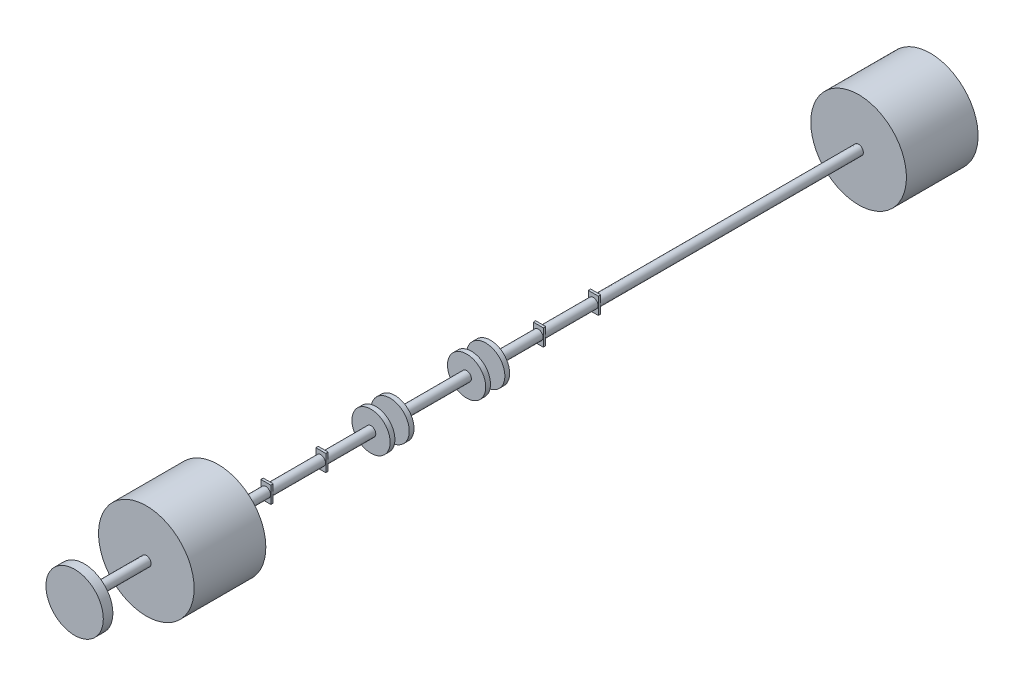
ISO-10303-21;
HEADER;
FILE_DESCRIPTION(('STEP AP214'),'2;1');
FILE_NAME('part.step','',(''),(''),'','','');
FILE_SCHEMA(('AUTOMOTIVE_DESIGN { 1 0 10303 214 1 1 1 1 }'));
ENDSEC;
DATA;
#1=APPLICATION_CONTEXT('core data for automotive mechanical design processes');
#2=APPLICATION_PROTOCOL_DEFINITION('international standard','automotive_design',2000,#1);
#3=PRODUCT_CONTEXT('',#1,'mechanical');
#4=PRODUCT('Part','Part','',(#3));
#5=PRODUCT_RELATED_PRODUCT_CATEGORY('part','',(#4));
#6=PRODUCT_DEFINITION_FORMATION('','',#4);
#7=PRODUCT_DEFINITION_CONTEXT('part definition',#1,'design');
#8=PRODUCT_DEFINITION('design','',#6,#7);
#9=PRODUCT_DEFINITION_SHAPE('','',#8);
#10=(LENGTH_UNIT() NAMED_UNIT(*) SI_UNIT(.MILLI.,.METRE.));
#11=(NAMED_UNIT(*) PLANE_ANGLE_UNIT() SI_UNIT($,.RADIAN.));
#12=(NAMED_UNIT(*) SI_UNIT($,.STERADIAN.) SOLID_ANGLE_UNIT());
#13=UNCERTAINTY_MEASURE_WITH_UNIT(LENGTH_MEASURE(1.E-05),#10,'distance_accuracy_value','');
#14=(GEOMETRIC_REPRESENTATION_CONTEXT(3) GLOBAL_UNCERTAINTY_ASSIGNED_CONTEXT((#13)) GLOBAL_UNIT_ASSIGNED_CONTEXT((#10,
#11,#12)) REPRESENTATION_CONTEXT('',''));
#15=CARTESIAN_POINT('',(0.,0.,0.));
#16=DIRECTION('',(0.,0.,1.));
#17=DIRECTION('',(1.,0.,0.));
#18=AXIS2_PLACEMENT_3D('',#15,#16,#17);
#19=CARTESIAN_POINT('',(0.,0.,250.));
#20=DIRECTION('',(0.,0.,1.));
#21=DIRECTION('',(1.,0.,0.));
#22=AXIS2_PLACEMENT_3D('',#19,#20,#21);
#23=PLANE('',#22);
#24=CARTESIAN_POINT('',(0.,0.,250.));
#25=DIRECTION('',(0.,0.,1.));
#26=DIRECTION('',(1.,0.,0.));
#27=AXIS2_PLACEMENT_3D('',#24,#25,#26);
#28=CIRCLE('',#27,100.);
#29=CARTESIAN_POINT('',(100.,0.,250.));
#30=VERTEX_POINT('',#29);
#31=EDGE_CURVE('E417',#30,#30,#28,.T.);
#32=ORIENTED_EDGE('',*,*,#31,.T.);
#33=EDGE_LOOP('',(#32));
#34=FACE_BOUND('',#33,.T.);
#35=CARTESIAN_POINT('',(0.,0.,250.));
#36=DIRECTION('',(0.,0.,1.));
#37=DIRECTION('',(1.,0.,0.));
#38=AXIS2_PLACEMENT_3D('',#35,#36,#37);
#39=CIRCLE('',#38,10.);
#40=CARTESIAN_POINT('',(10.,0.,250.));
#41=VERTEX_POINT('',#40);
#42=EDGE_CURVE('E403',#41,#41,#39,.T.);
#43=ORIENTED_EDGE('',*,*,#42,.F.);
#44=EDGE_LOOP('',(#43));
#45=FACE_BOUND('',#44,.T.);
#46=ADVANCED_FACE('F41',(#34,#45),#23,.T.);
#47=CARTESIAN_POINT('',(0.,0.,-230.));
#48=DIRECTION('',(0.,0.,-1.));
#49=DIRECTION('',(-1.,0.,0.));
#50=AXIS2_PLACEMENT_3D('',#47,#48,#49);
#51=PLANE('',#50);
#52=CARTESIAN_POINT('',(0.,0.,-230.));
#53=DIRECTION('',(0.,0.,-1.));
#54=DIRECTION('',(-1.,0.,0.));
#55=AXIS2_PLACEMENT_3D('',#52,#53,#54);
#56=CIRCLE('',#55,40.);
#57=CARTESIAN_POINT('',(-40.,0.,-230.));
#58=VERTEX_POINT('',#57);
#59=EDGE_CURVE('E418',#58,#58,#56,.T.);
#60=ORIENTED_EDGE('',*,*,#59,.T.);
#61=EDGE_LOOP('',(#60));
#62=FACE_BOUND('',#61,.T.);
#63=ADVANCED_FACE('F169',(#62),#51,.T.);
#64=CARTESIAN_POINT('',(10.5,17.5,-120.));
#65=DIRECTION('',(0.,0.,-1.));
#66=DIRECTION('',(-1.,0.,0.));
#67=AXIS2_PLACEMENT_3D('',#64,#65,#66);
#68=PLANE('',#67);
#69=DIRECTION('',(1.,0.,0.));
#70=VECTOR('',#69,1.);
#71=CARTESIAN_POINT('',(-10.5,17.5,-120.));
#72=LINE('',#71,#70);
#73=CARTESIAN_POINT('',(-10.5,17.5,-120.));
#74=VERTEX_POINT('',#73);
#75=CARTESIAN_POINT('',(10.5,17.5,-120.));
#76=VERTEX_POINT('',#75);
#77=EDGE_CURVE('E422',#74,#76,#72,.T.);
#78=ORIENTED_EDGE('',*,*,#77,.T.);
#79=DIRECTION('',(0.,-1.,0.));
#80=VECTOR('',#79,1.);
#81=CARTESIAN_POINT('',(10.5,17.5,-120.));
#82=LINE('',#81,#80);
#83=CARTESIAN_POINT('',(10.5,-17.5,-120.));
#84=VERTEX_POINT('',#83);
#85=EDGE_CURVE('E444',#76,#84,#82,.T.);
#86=ORIENTED_EDGE('',*,*,#85,.T.);
#87=DIRECTION('',(-1.,0.,0.));
#88=VECTOR('',#87,1.);
#89=CARTESIAN_POINT('',(10.5,-17.5,-120.));
#90=LINE('',#89,#88);
#91=CARTESIAN_POINT('',(-10.5,-17.5,-120.));
#92=VERTEX_POINT('',#91);
#93=EDGE_CURVE('E134',#84,#92,#90,.T.);
#94=ORIENTED_EDGE('',*,*,#93,.T.);
#95=DIRECTION('',(0.,1.,0.));
#96=VECTOR('',#95,1.);
#97=CARTESIAN_POINT('',(-10.5,-17.5,-120.));
#98=LINE('',#97,#96);
#99=EDGE_CURVE('E131',#92,#74,#98,.T.);
#100=ORIENTED_EDGE('',*,*,#99,.T.);
#101=EDGE_LOOP('',(#78,#86,#94,#100));
#102=FACE_BOUND('',#101,.T.);
#103=CARTESIAN_POINT('',(0.,0.,-120.));
#104=DIRECTION('',(0.,0.,-1.));
#105=DIRECTION('',(-1.,0.,0.));
#106=AXIS2_PLACEMENT_3D('',#103,#104,#105);
#107=CIRCLE('',#106,10.);
#108=CARTESIAN_POINT('',(-10.,0.,-120.));
#109=VERTEX_POINT('',#108);
#110=EDGE_CURVE('E423',#109,#109,#107,.T.);
#111=ORIENTED_EDGE('',*,*,#110,.F.);
#112=EDGE_LOOP('',(#111));
#113=FACE_BOUND('',#112,.T.);
#114=ADVANCED_FACE('F166',(#102,#113),#68,.T.);
#115=CARTESIAN_POINT('',(10.5,-17.5,-5.));
#116=DIRECTION('',(0.,0.,-1.));
#117=DIRECTION('',(-1.,0.,0.));
#118=AXIS2_PLACEMENT_3D('',#115,#116,#117);
#119=PLANE('',#118);
#120=DIRECTION('',(0.,-1.,0.));
#121=VECTOR('',#120,1.);
#122=CARTESIAN_POINT('',(10.5,17.5,-5.));
#123=LINE('',#122,#121);
#124=CARTESIAN_POINT('',(10.5,17.5,-5.));
#125=VERTEX_POINT('',#124);
#126=CARTESIAN_POINT('',(10.5,-17.5,-5.));
#127=VERTEX_POINT('',#126);
#128=EDGE_CURVE('E111',#125,#127,#123,.T.);
#129=ORIENTED_EDGE('',*,*,#128,.T.);
#130=DIRECTION('',(-1.,0.,0.));
#131=VECTOR('',#130,1.);
#132=CARTESIAN_POINT('',(10.5,-17.5,-5.));
#133=LINE('',#132,#131);
#134=CARTESIAN_POINT('',(-10.5,-17.5,-5.));
#135=VERTEX_POINT('',#134);
#136=EDGE_CURVE('E130',#127,#135,#133,.T.);
#137=ORIENTED_EDGE('',*,*,#136,.T.);
#138=DIRECTION('',(0.,1.,0.));
#139=VECTOR('',#138,1.);
#140=CARTESIAN_POINT('',(-10.5,17.5,-5.));
#141=LINE('',#140,#139);
#142=CARTESIAN_POINT('',(-10.5,17.5,-5.));
#143=VERTEX_POINT('',#142);
#144=EDGE_CURVE('E102',#135,#143,#141,.T.);
#145=ORIENTED_EDGE('',*,*,#144,.T.);
#146=DIRECTION('',(1.,0.,0.));
#147=VECTOR('',#146,1.);
#148=CARTESIAN_POINT('',(10.5,17.5,-5.));
#149=LINE('',#148,#147);
#150=EDGE_CURVE('E106',#143,#125,#149,.T.);
#151=ORIENTED_EDGE('',*,*,#150,.T.);
#152=EDGE_LOOP('',(#129,#137,#145,#151));
#153=FACE_BOUND('',#152,.T.);
#154=CARTESIAN_POINT('',(0.,0.,-5.));
#155=DIRECTION('',(0.,0.,-1.));
#156=DIRECTION('',(-1.,0.,0.));
#157=AXIS2_PLACEMENT_3D('',#154,#155,#156);
#158=CIRCLE('',#157,10.);
#159=CARTESIAN_POINT('',(-10.,0.,-5.));
#160=VERTEX_POINT('',#159);
#161=EDGE_CURVE('E142',#160,#160,#158,.T.);
#162=ORIENTED_EDGE('',*,*,#161,.F.);
#163=EDGE_LOOP('',(#162));
#164=FACE_BOUND('',#163,.T.);
#165=ADVANCED_FACE('F108',(#153,#164),#119,.T.);
#166=CARTESIAN_POINT('',(0.,0.,100.));
#167=DIRECTION('',(0.,0.,-1.));
#168=DIRECTION('',(-1.,0.,0.));
#169=AXIS2_PLACEMENT_3D('',#166,#167,#168);
#170=CYLINDRICAL_SURFACE('',#169,10.);
#171=CARTESIAN_POINT('',(0.,0.,100.));
#172=DIRECTION('',(0.,0.,1.));
#173=DIRECTION('',(1.,0.,0.));
#174=AXIS2_PLACEMENT_3D('',#171,#172,#173);
#175=CIRCLE('',#174,10.);
#176=CARTESIAN_POINT('',(10.,0.,100.));
#177=VERTEX_POINT('',#176);
#178=EDGE_CURVE('E45',#177,#177,#175,.T.);
#179=ORIENTED_EDGE('',*,*,#178,.F.);
#180=EDGE_LOOP('',(#179));
#181=FACE_BOUND('',#180,.T.);
#182=CARTESIAN_POINT('',(0.,0.,0.));
#183=DIRECTION('',(0.,0.,-1.));
#184=DIRECTION('',(-1.,0.,0.));
#185=AXIS2_PLACEMENT_3D('',#182,#183,#184);
#186=CIRCLE('',#185,10.);
#187=CARTESIAN_POINT('',(-10.,0.,0.));
#188=VERTEX_POINT('',#187);
#189=EDGE_CURVE('E147',#188,#188,#186,.T.);
#190=ORIENTED_EDGE('',*,*,#189,.F.);
#191=EDGE_LOOP('',(#190));
#192=FACE_BOUND('',#191,.T.);
#193=ADVANCED_FACE('F43',(#181,#192),#170,.T.);
#194=CARTESIAN_POINT('',(10.5,-17.5,0.));
#195=DIRECTION('',(0.,0.,-1.));
#196=DIRECTION('',(-1.,0.,0.));
#197=AXIS2_PLACEMENT_3D('',#194,#195,#196);
#198=PLANE('',#197);
#199=DIRECTION('',(0.,-1.,0.));
#200=VECTOR('',#199,1.);
#201=CARTESIAN_POINT('',(10.5,17.5,0.));
#202=LINE('',#201,#200);
#203=CARTESIAN_POINT('',(10.5,17.5,0.));
#204=VERTEX_POINT('',#203);
#205=CARTESIAN_POINT('',(10.5,-17.5,0.));
#206=VERTEX_POINT('',#205);
#207=EDGE_CURVE('E125',#204,#206,#202,.T.);
#208=ORIENTED_EDGE('',*,*,#207,.F.);
#209=DIRECTION('',(1.,0.,0.));
#210=VECTOR('',#209,1.);
#211=CARTESIAN_POINT('',(10.5,17.5,0.));
#212=LINE('',#211,#210);
#213=CARTESIAN_POINT('',(-10.5,17.5,0.));
#214=VERTEX_POINT('',#213);
#215=EDGE_CURVE('E120',#214,#204,#212,.T.);
#216=ORIENTED_EDGE('',*,*,#215,.F.);
#217=DIRECTION('',(0.,1.,0.));
#218=VECTOR('',#217,1.);
#219=CARTESIAN_POINT('',(-10.5,17.5,0.));
#220=LINE('',#219,#218);
#221=CARTESIAN_POINT('',(-10.5,-17.5,0.));
#222=VERTEX_POINT('',#221);
#223=EDGE_CURVE('E146',#222,#214,#220,.T.);
#224=ORIENTED_EDGE('',*,*,#223,.F.);
#225=DIRECTION('',(-1.,0.,0.));
#226=VECTOR('',#225,1.);
#227=CARTESIAN_POINT('',(10.5,-17.5,0.));
#228=LINE('',#227,#226);
#229=EDGE_CURVE('E124',#206,#222,#228,.T.);
#230=ORIENTED_EDGE('',*,*,#229,.F.);
#231=EDGE_LOOP('',(#208,#216,#224,#230));
#232=FACE_BOUND('',#231,.T.);
#233=ORIENTED_EDGE('',*,*,#189,.T.);
#234=EDGE_LOOP('',(#233));
#235=FACE_BOUND('',#234,.T.);
#236=ADVANCED_FACE('F159',(#232,#235),#198,.F.);
#237=CARTESIAN_POINT('',(10.5,17.5,-5.));
#238=DIRECTION('',(-1.,0.,0.));
#239=DIRECTION('',(0.,-1.,0.));
#240=AXIS2_PLACEMENT_3D('',#237,#238,#239);
#241=PLANE('',#240);
#242=ORIENTED_EDGE('',*,*,#207,.T.);
#243=DIRECTION('',(0.,0.,1.));
#244=VECTOR('',#243,1.);
#245=CARTESIAN_POINT('',(10.5,-17.5,-5.));
#246=LINE('',#245,#244);
#247=EDGE_CURVE('E129',#127,#206,#246,.T.);
#248=ORIENTED_EDGE('',*,*,#247,.F.);
#249=ORIENTED_EDGE('',*,*,#128,.F.);
#250=DIRECTION('',(0.,0.,1.));
#251=VECTOR('',#250,1.);
#252=CARTESIAN_POINT('',(10.5,17.5,-5.));
#253=LINE('',#252,#251);
#254=EDGE_CURVE('E117',#125,#204,#253,.T.);
#255=ORIENTED_EDGE('',*,*,#254,.T.);
#256=EDGE_LOOP('',(#242,#248,#249,#255));
#257=FACE_BOUND('',#256,.T.);
#258=ADVANCED_FACE('F127',(#257),#241,.F.);
#259=CARTESIAN_POINT('',(10.5,-17.5,-5.));
#260=DIRECTION('',(0.,1.,0.));
#261=DIRECTION('',(-1.,0.,0.));
#262=AXIS2_PLACEMENT_3D('',#259,#260,#261);
#263=PLANE('',#262);
#264=ORIENTED_EDGE('',*,*,#229,.T.);
#265=DIRECTION('',(0.,0.,1.));
#266=VECTOR('',#265,1.);
#267=CARTESIAN_POINT('',(-10.5,-17.5,-5.));
#268=LINE('',#267,#266);
#269=EDGE_CURVE('E143',#135,#222,#268,.T.);
#270=ORIENTED_EDGE('',*,*,#269,.F.);
#271=ORIENTED_EDGE('',*,*,#136,.F.);
#272=ORIENTED_EDGE('',*,*,#247,.T.);
#273=EDGE_LOOP('',(#264,#270,#271,#272));
#274=FACE_BOUND('',#273,.T.);
#275=ADVANCED_FACE('F230',(#274),#263,.F.);
#276=CARTESIAN_POINT('',(-10.5,17.5,-5.));
#277=DIRECTION('',(1.,0.,0.));
#278=DIRECTION('',(0.,1.,0.));
#279=AXIS2_PLACEMENT_3D('',#276,#277,#278);
#280=PLANE('',#279);
#281=ORIENTED_EDGE('',*,*,#223,.T.);
#282=DIRECTION('',(0.,0.,1.));
#283=VECTOR('',#282,1.);
#284=CARTESIAN_POINT('',(-10.5,17.5,-5.));
#285=LINE('',#284,#283);
#286=EDGE_CURVE('E140',#143,#214,#285,.T.);
#287=ORIENTED_EDGE('',*,*,#286,.F.);
#288=ORIENTED_EDGE('',*,*,#144,.F.);
#289=ORIENTED_EDGE('',*,*,#269,.T.);
#290=EDGE_LOOP('',(#281,#287,#288,#289));
#291=FACE_BOUND('',#290,.T.);
#292=ADVANCED_FACE('F227',(#291),#280,.F.);
#293=CARTESIAN_POINT('',(10.5,17.5,-5.));
#294=DIRECTION('',(0.,-1.,0.));
#295=DIRECTION('',(1.,0.,0.));
#296=AXIS2_PLACEMENT_3D('',#293,#294,#295);
#297=PLANE('',#296);
#298=ORIENTED_EDGE('',*,*,#215,.T.);
#299=ORIENTED_EDGE('',*,*,#254,.F.);
#300=ORIENTED_EDGE('',*,*,#150,.F.);
#301=ORIENTED_EDGE('',*,*,#286,.T.);
#302=EDGE_LOOP('',(#298,#299,#300,#301));
#303=FACE_BOUND('',#302,.T.);
#304=ADVANCED_FACE('F118',(#303),#297,.F.);
#305=CARTESIAN_POINT('',(0.,0.,-115.));
#306=DIRECTION('',(0.,0.,1.));
#307=DIRECTION('',(1.,0.,0.));
#308=AXIS2_PLACEMENT_3D('',#305,#306,#307);
#309=CYLINDRICAL_SURFACE('',#308,10.);
#310=CARTESIAN_POINT('',(0.,0.,-115.));
#311=DIRECTION('',(0.,0.,-1.));
#312=DIRECTION('',(-1.,0.,0.));
#313=AXIS2_PLACEMENT_3D('',#310,#311,#312);
#314=CIRCLE('',#313,10.);
#315=CARTESIAN_POINT('',(-10.,0.,-115.));
#316=VERTEX_POINT('',#315);
#317=EDGE_CURVE('E433',#316,#316,#314,.T.);
#318=ORIENTED_EDGE('',*,*,#317,.F.);
#319=EDGE_LOOP('',(#318));
#320=FACE_BOUND('',#319,.T.);
#321=ORIENTED_EDGE('',*,*,#161,.T.);
#322=EDGE_LOOP('',(#321));
#323=FACE_BOUND('',#322,.T.);
#324=ADVANCED_FACE('F204',(#320,#323),#309,.T.);
#325=CARTESIAN_POINT('',(10.5,17.5,-115.));
#326=DIRECTION('',(0.,0.,-1.));
#327=DIRECTION('',(-1.,0.,0.));
#328=AXIS2_PLACEMENT_3D('',#325,#326,#327);
#329=PLANE('',#328);
#330=DIRECTION('',(1.,0.,0.));
#331=VECTOR('',#330,1.);
#332=CARTESIAN_POINT('',(-10.5,17.5,-115.));
#333=LINE('',#332,#331);
#334=CARTESIAN_POINT('',(-10.5,17.5,-115.));
#335=VERTEX_POINT('',#334);
#336=CARTESIAN_POINT('',(10.5,17.5,-115.));
#337=VERTEX_POINT('',#336);
#338=EDGE_CURVE('E429',#335,#337,#333,.T.);
#339=ORIENTED_EDGE('',*,*,#338,.F.);
#340=DIRECTION('',(0.,1.,0.));
#341=VECTOR('',#340,1.);
#342=CARTESIAN_POINT('',(-10.5,-17.5,-115.));
#343=LINE('',#342,#341);
#344=CARTESIAN_POINT('',(-10.5,-17.5,-115.));
#345=VERTEX_POINT('',#344);
#346=EDGE_CURVE('E60',#345,#335,#343,.T.);
#347=ORIENTED_EDGE('',*,*,#346,.F.);
#348=DIRECTION('',(-1.,0.,0.));
#349=VECTOR('',#348,1.);
#350=CARTESIAN_POINT('',(10.5,-17.5,-115.));
#351=LINE('',#350,#349);
#352=CARTESIAN_POINT('',(10.5,-17.5,-115.));
#353=VERTEX_POINT('',#352);
#354=EDGE_CURVE('E438',#353,#345,#351,.T.);
#355=ORIENTED_EDGE('',*,*,#354,.F.);
#356=DIRECTION('',(0.,-1.,0.));
#357=VECTOR('',#356,1.);
#358=CARTESIAN_POINT('',(10.5,17.5,-115.));
#359=LINE('',#358,#357);
#360=EDGE_CURVE('E434',#337,#353,#359,.T.);
#361=ORIENTED_EDGE('',*,*,#360,.F.);
#362=EDGE_LOOP('',(#339,#347,#355,#361));
#363=FACE_BOUND('',#362,.T.);
#364=ORIENTED_EDGE('',*,*,#317,.T.);
#365=EDGE_LOOP('',(#364));
#366=FACE_BOUND('',#365,.T.);
#367=ADVANCED_FACE('F200',(#363,#366),#329,.F.);
#368=CARTESIAN_POINT('',(-10.5,17.5,-120.));
#369=DIRECTION('',(0.,-1.,0.));
#370=DIRECTION('',(1.,0.,0.));
#371=AXIS2_PLACEMENT_3D('',#368,#369,#370);
#372=PLANE('',#371);
#373=ORIENTED_EDGE('',*,*,#338,.T.);
#374=DIRECTION('',(0.,0.,1.));
#375=VECTOR('',#374,1.);
#376=CARTESIAN_POINT('',(10.5,17.5,-120.));
#377=LINE('',#376,#375);
#378=EDGE_CURVE('E437',#76,#337,#377,.T.);
#379=ORIENTED_EDGE('',*,*,#378,.F.);
#380=ORIENTED_EDGE('',*,*,#77,.F.);
#381=DIRECTION('',(0.,0.,1.));
#382=VECTOR('',#381,1.);
#383=CARTESIAN_POINT('',(-10.5,17.5,-120.));
#384=LINE('',#383,#382);
#385=EDGE_CURVE('E432',#74,#335,#384,.T.);
#386=ORIENTED_EDGE('',*,*,#385,.T.);
#387=EDGE_LOOP('',(#373,#379,#380,#386));
#388=FACE_BOUND('',#387,.T.);
#389=ADVANCED_FACE('F203',(#388),#372,.F.);
#390=CARTESIAN_POINT('',(10.5,17.5,-120.));
#391=DIRECTION('',(-1.,0.,0.));
#392=DIRECTION('',(0.,-1.,0.));
#393=AXIS2_PLACEMENT_3D('',#390,#391,#392);
#394=PLANE('',#393);
#395=ORIENTED_EDGE('',*,*,#360,.T.);
#396=DIRECTION('',(0.,0.,1.));
#397=VECTOR('',#396,1.);
#398=CARTESIAN_POINT('',(10.5,-17.5,-120.));
#399=LINE('',#398,#397);
#400=EDGE_CURVE('E440',#84,#353,#399,.T.);
#401=ORIENTED_EDGE('',*,*,#400,.F.);
#402=ORIENTED_EDGE('',*,*,#85,.F.);
#403=ORIENTED_EDGE('',*,*,#378,.T.);
#404=EDGE_LOOP('',(#395,#401,#402,#403));
#405=FACE_BOUND('',#404,.T.);
#406=ADVANCED_FACE('F214',(#405),#394,.F.);
#407=CARTESIAN_POINT('',(10.5,-17.5,-120.));
#408=DIRECTION('',(0.,1.,0.));
#409=DIRECTION('',(-1.,0.,0.));
#410=AXIS2_PLACEMENT_3D('',#407,#408,#409);
#411=PLANE('',#410);
#412=ORIENTED_EDGE('',*,*,#354,.T.);
#413=DIRECTION('',(0.,0.,1.));
#414=VECTOR('',#413,1.);
#415=CARTESIAN_POINT('',(-10.5,-17.5,-120.));
#416=LINE('',#415,#414);
#417=EDGE_CURVE('E426',#92,#345,#416,.T.);
#418=ORIENTED_EDGE('',*,*,#417,.F.);
#419=ORIENTED_EDGE('',*,*,#93,.F.);
#420=ORIENTED_EDGE('',*,*,#400,.T.);
#421=EDGE_LOOP('',(#412,#418,#419,#420));
#422=FACE_BOUND('',#421,.T.);
#423=ADVANCED_FACE('F211',(#422),#411,.F.);
#424=CARTESIAN_POINT('',(-10.5,-17.5,-120.));
#425=DIRECTION('',(1.,0.,0.));
#426=DIRECTION('',(0.,1.,0.));
#427=AXIS2_PLACEMENT_3D('',#424,#425,#426);
#428=PLANE('',#427);
#429=ORIENTED_EDGE('',*,*,#346,.T.);
#430=ORIENTED_EDGE('',*,*,#385,.F.);
#431=ORIENTED_EDGE('',*,*,#99,.F.);
#432=ORIENTED_EDGE('',*,*,#417,.T.);
#433=EDGE_LOOP('',(#429,#430,#431,#432));
#434=FACE_BOUND('',#433,.T.);
#435=ADVANCED_FACE('F198',(#434),#428,.F.);
#436=CARTESIAN_POINT('',(0.,0.,-220.));
#437=DIRECTION('',(0.,0.,1.));
#438=DIRECTION('',(1.,0.,0.));
#439=AXIS2_PLACEMENT_3D('',#436,#437,#438);
#440=CYLINDRICAL_SURFACE('',#439,10.);
#441=CARTESIAN_POINT('',(0.,0.,-220.));
#442=DIRECTION('',(0.,0.,-1.));
#443=DIRECTION('',(-1.,0.,0.));
#444=AXIS2_PLACEMENT_3D('',#441,#442,#443);
#445=CIRCLE('',#444,10.);
#446=CARTESIAN_POINT('',(-10.,0.,-220.));
#447=VERTEX_POINT('',#446);
#448=EDGE_CURVE('E51',#447,#447,#445,.T.);
#449=ORIENTED_EDGE('',*,*,#448,.F.);
#450=EDGE_LOOP('',(#449));
#451=FACE_BOUND('',#450,.T.);
#452=ORIENTED_EDGE('',*,*,#110,.T.);
#453=EDGE_LOOP('',(#452));
#454=FACE_BOUND('',#453,.T.);
#455=ADVANCED_FACE('F190',(#451,#454),#440,.T.);
#456=CARTESIAN_POINT('',(0.,0.,-220.));
#457=DIRECTION('',(0.,0.,-1.));
#458=DIRECTION('',(-1.,0.,0.));
#459=AXIS2_PLACEMENT_3D('',#456,#457,#458);
#460=PLANE('',#459);
#461=CARTESIAN_POINT('',(0.,0.,-220.));
#462=DIRECTION('',(0.,0.,-1.));
#463=DIRECTION('',(-1.,0.,0.));
#464=AXIS2_PLACEMENT_3D('',#461,#462,#463);
#465=CIRCLE('',#464,40.);
#466=CARTESIAN_POINT('',(-40.,0.,-220.));
#467=VERTEX_POINT('',#466);
#468=EDGE_CURVE('E12',#467,#467,#465,.T.);
#469=ORIENTED_EDGE('',*,*,#468,.F.);
#470=EDGE_LOOP('',(#469));
#471=FACE_BOUND('',#470,.T.);
#472=ORIENTED_EDGE('',*,*,#448,.T.);
#473=EDGE_LOOP('',(#472));
#474=FACE_BOUND('',#473,.T.);
#475=ADVANCED_FACE('F187',(#471,#474),#460,.F.);
#476=CARTESIAN_POINT('',(0.,0.,-230.));
#477=DIRECTION('',(0.,0.,1.));
#478=DIRECTION('',(1.,0.,0.));
#479=AXIS2_PLACEMENT_3D('',#476,#477,#478);
#480=CYLINDRICAL_SURFACE('',#479,40.);
#481=ORIENTED_EDGE('',*,*,#59,.F.);
#482=EDGE_LOOP('',(#481));
#483=FACE_BOUND('',#482,.T.);
#484=ORIENTED_EDGE('',*,*,#468,.T.);
#485=EDGE_LOOP('',(#484));
#486=FACE_BOUND('',#485,.T.);
#487=ADVANCED_FACE('F189',(#483,#486),#480,.T.);
#488=CARTESIAN_POINT('',(0.,0.,100.));
#489=DIRECTION('',(0.,0.,1.));
#490=DIRECTION('',(1.,0.,0.));
#491=AXIS2_PLACEMENT_3D('',#488,#489,#490);
#492=PLANE('',#491);
#493=CARTESIAN_POINT('',(0.,0.,100.));
#494=DIRECTION('',(0.,0.,1.));
#495=DIRECTION('',(1.,0.,0.));
#496=AXIS2_PLACEMENT_3D('',#493,#494,#495);
#497=CIRCLE('',#496,100.);
#498=CARTESIAN_POINT('',(100.,0.,100.));
#499=VERTEX_POINT('',#498);
#500=EDGE_CURVE('E414',#499,#499,#497,.T.);
#501=ORIENTED_EDGE('',*,*,#500,.F.);
#502=EDGE_LOOP('',(#501));
#503=FACE_BOUND('',#502,.T.);
#504=ORIENTED_EDGE('',*,*,#178,.T.);
#505=EDGE_LOOP('',(#504));
#506=FACE_BOUND('',#505,.T.);
#507=ADVANCED_FACE('F155',(#503,#506),#492,.F.);
#508=CARTESIAN_POINT('',(0.,0.,250.));
#509=DIRECTION('',(0.,0.,-1.));
#510=DIRECTION('',(-1.,0.,0.));
#511=AXIS2_PLACEMENT_3D('',#508,#509,#510);
#512=CYLINDRICAL_SURFACE('',#511,100.);
#513=ORIENTED_EDGE('',*,*,#31,.F.);
#514=EDGE_LOOP('',(#513));
#515=FACE_BOUND('',#514,.T.);
#516=ORIENTED_EDGE('',*,*,#500,.T.);
#517=EDGE_LOOP('',(#516));
#518=FACE_BOUND('',#517,.T.);
#519=ADVANCED_FACE('F182',(#515,#518),#512,.T.);
#520=CARTESIAN_POINT('',(0.,0.,380.));
#521=DIRECTION('',(0.,0.,-1.));
#522=DIRECTION('',(-1.,0.,0.));
#523=AXIS2_PLACEMENT_3D('',#520,#521,#522);
#524=CYLINDRICAL_SURFACE('',#523,10.);
#525=CARTESIAN_POINT('',(0.,0.,380.));
#526=DIRECTION('',(0.,0.,1.));
#527=DIRECTION('',(1.,0.,0.));
#528=AXIS2_PLACEMENT_3D('',#525,#526,#527);
#529=CIRCLE('',#528,10.);
#530=CARTESIAN_POINT('',(10.,0.,380.));
#531=VERTEX_POINT('',#530);
#532=EDGE_CURVE('E407',#531,#531,#529,.T.);
#533=ORIENTED_EDGE('',*,*,#532,.F.);
#534=EDGE_LOOP('',(#533));
#535=FACE_BOUND('',#534,.T.);
#536=ORIENTED_EDGE('',*,*,#42,.T.);
#537=EDGE_LOOP('',(#536));
#538=FACE_BOUND('',#537,.T.);
#539=ADVANCED_FACE('F185',(#535,#538),#524,.T.);
#540=CARTESIAN_POINT('',(0.,0.,380.));
#541=DIRECTION('',(0.,0.,1.));
#542=DIRECTION('',(1.,0.,0.));
#543=AXIS2_PLACEMENT_3D('',#540,#541,#542);
#544=PLANE('',#543);
#545=CARTESIAN_POINT('',(0.,0.,380.));
#546=DIRECTION('',(0.,0.,1.));
#547=DIRECTION('',(1.,0.,0.));
#548=AXIS2_PLACEMENT_3D('',#545,#546,#547);
#549=CIRCLE('',#548,60.);
#550=CARTESIAN_POINT('',(60.,0.,380.));
#551=VERTEX_POINT('',#550);
#552=EDGE_CURVE('E404',#551,#551,#549,.T.);
#553=ORIENTED_EDGE('',*,*,#552,.F.);
#554=EDGE_LOOP('',(#553));
#555=FACE_BOUND('',#554,.T.);
#556=ORIENTED_EDGE('',*,*,#532,.T.);
#557=EDGE_LOOP('',(#556));
#558=FACE_BOUND('',#557,.T.);
#559=ADVANCED_FACE('F303',(#555,#558),#544,.F.);
#560=CARTESIAN_POINT('',(0.,0.,400.));
#561=DIRECTION('',(0.,0.,-1.));
#562=DIRECTION('',(-1.,0.,0.));
#563=AXIS2_PLACEMENT_3D('',#560,#561,#562);
#564=CYLINDRICAL_SURFACE('',#563,60.);
#565=CARTESIAN_POINT('',(0.,0.,400.));
#566=DIRECTION('',(0.,0.,1.));
#567=DIRECTION('',(1.,0.,0.));
#568=AXIS2_PLACEMENT_3D('',#565,#566,#567);
#569=CIRCLE('',#568,60.);
#570=CARTESIAN_POINT('',(60.,0.,400.));
#571=VERTEX_POINT('',#570);
#572=EDGE_CURVE('E402',#571,#571,#569,.T.);
#573=ORIENTED_EDGE('',*,*,#572,.F.);
#574=EDGE_LOOP('',(#573));
#575=FACE_BOUND('',#574,.T.);
#576=ORIENTED_EDGE('',*,*,#552,.T.);
#577=EDGE_LOOP('',(#576));
#578=FACE_BOUND('',#577,.T.);
#579=ADVANCED_FACE('F310',(#575,#578),#564,.T.);
#580=CARTESIAN_POINT('',(0.,0.,400.));
#581=DIRECTION('',(0.,0.,1.));
#582=DIRECTION('',(1.,0.,0.));
#583=AXIS2_PLACEMENT_3D('',#580,#581,#582);
#584=PLANE('',#583);
#585=ORIENTED_EDGE('',*,*,#572,.T.);
#586=EDGE_LOOP('',(#585));
#587=FACE_BOUND('',#586,.T.);
#588=ADVANCED_FACE('F318',(#587),#584,.T.);
#589=CLOSED_SHELL('',(#46,#63,#114,#165,#193,#236,#258,#275,#292,#304,#324,#367,#389,#406,#423,
#435,#455,#475,#487,#507,#519,#539,#559,#579,#588));
#590=MANIFOLD_SOLID_BREP('B2',#589);
#591=CARTESIAN_POINT('',(0.,0.,-430.));
#592=DIRECTION('',(0.,0.,-1.));
#593=DIRECTION('',(-1.,0.,0.));
#594=AXIS2_PLACEMENT_3D('',#591,#592,#593);
#595=PLANE('',#594);
#596=CARTESIAN_POINT('',(0.,0.,-430.));
#597=DIRECTION('',(0.,0.,-1.));
#598=DIRECTION('',(-1.,0.,0.));
#599=AXIS2_PLACEMENT_3D('',#596,#597,#598);
#600=CIRCLE('',#599,40.);
#601=CARTESIAN_POINT('',(-40.,0.,-430.));
#602=VERTEX_POINT('',#601);
#603=EDGE_CURVE('E521',#602,#602,#600,.T.);
#604=ORIENTED_EDGE('',*,*,#603,.T.);
#605=EDGE_LOOP('',(#604));
#606=FACE_BOUND('',#605,.T.);
#607=ADVANCED_FACE('F501',(#606),#595,.T.);
#608=CARTESIAN_POINT('',(0.,0.,-430.));
#609=DIRECTION('',(0.,0.,1.));
#610=DIRECTION('',(1.,0.,0.));
#611=AXIS2_PLACEMENT_3D('',#608,#609,#610);
#612=CYLINDRICAL_SURFACE('',#611,40.);
#613=ORIENTED_EDGE('',*,*,#603,.F.);
#614=EDGE_LOOP('',(#613));
#615=FACE_BOUND('',#614,.T.);
#616=CARTESIAN_POINT('',(0.,0.,-420.));
#617=DIRECTION('',(0.,0.,-1.));
#618=DIRECTION('',(-1.,0.,0.));
#619=AXIS2_PLACEMENT_3D('',#616,#617,#618);
#620=CIRCLE('',#619,40.);
#621=CARTESIAN_POINT('',(-40.,0.,-420.));
#622=VERTEX_POINT('',#621);
#623=EDGE_CURVE('E40',#622,#622,#620,.T.);
#624=ORIENTED_EDGE('',*,*,#623,.T.);
#625=EDGE_LOOP('',(#624));
#626=FACE_BOUND('',#625,.T.);
#627=ADVANCED_FACE('F546',(#615,#626),#612,.T.);
#628=CARTESIAN_POINT('',(0.,0.,-420.));
#629=DIRECTION('',(0.,0.,-1.));
#630=DIRECTION('',(-1.,0.,0.));
#631=AXIS2_PLACEMENT_3D('',#628,#629,#630);
#632=PLANE('',#631);
#633=ORIENTED_EDGE('',*,*,#623,.F.);
#634=EDGE_LOOP('',(#633));
#635=FACE_BOUND('',#634,.T.);
#636=CARTESIAN_POINT('',(0.,0.,-420.));
#637=DIRECTION('',(0.,0.,-1.));
#638=DIRECTION('',(-1.,0.,0.));
#639=AXIS2_PLACEMENT_3D('',#636,#637,#638);
#640=CIRCLE('',#639,10.);
#641=CARTESIAN_POINT('',(-10.,0.,-420.));
#642=VERTEX_POINT('',#641);
#643=EDGE_CURVE('E508',#642,#642,#640,.T.);
#644=ORIENTED_EDGE('',*,*,#643,.T.);
#645=EDGE_LOOP('',(#644));
#646=FACE_BOUND('',#645,.T.);
#647=ADVANCED_FACE('F503',(#635,#646),#632,.F.);
#648=CARTESIAN_POINT('',(0.,0.,-420.));
#649=DIRECTION('',(0.,0.,1.));
#650=DIRECTION('',(1.,0.,0.));
#651=AXIS2_PLACEMENT_3D('',#648,#649,#650);
#652=CYLINDRICAL_SURFACE('',#651,10.);
#653=ORIENTED_EDGE('',*,*,#643,.F.);
#654=EDGE_LOOP('',(#653));
#655=FACE_BOUND('',#654,.T.);
#656=CARTESIAN_POINT('',(0.,0.,-270.));
#657=DIRECTION('',(0.,0.,-1.));
#658=DIRECTION('',(-1.,0.,0.));
#659=AXIS2_PLACEMENT_3D('',#656,#657,#658);
#660=CIRCLE('',#659,10.);
#661=CARTESIAN_POINT('',(-10.,0.,-270.));
#662=VERTEX_POINT('',#661);
#663=EDGE_CURVE('E512',#662,#662,#660,.T.);
#664=ORIENTED_EDGE('',*,*,#663,.T.);
#665=EDGE_LOOP('',(#664));
#666=FACE_BOUND('',#665,.T.);
#667=ADVANCED_FACE('F552',(#655,#666),#652,.T.);
#668=CARTESIAN_POINT('',(0.,0.,-270.));
#669=DIRECTION('',(0.,0.,-1.));
#670=DIRECTION('',(-1.,0.,0.));
#671=AXIS2_PLACEMENT_3D('',#668,#669,#670);
#672=PLANE('',#671);
#673=CARTESIAN_POINT('',(0.,0.,-270.));
#674=DIRECTION('',(0.,0.,-1.));
#675=DIRECTION('',(-1.,0.,0.));
#676=AXIS2_PLACEMENT_3D('',#673,#674,#675);
#677=CIRCLE('',#676,40.);
#678=CARTESIAN_POINT('',(-40.,0.,-270.));
#679=VERTEX_POINT('',#678);
#680=EDGE_CURVE('E523',#679,#679,#677,.T.);
#681=ORIENTED_EDGE('',*,*,#680,.T.);
#682=EDGE_LOOP('',(#681));
#683=FACE_BOUND('',#682,.T.);
#684=ORIENTED_EDGE('',*,*,#663,.F.);
#685=EDGE_LOOP('',(#684));
#686=FACE_BOUND('',#685,.T.);
#687=ADVANCED_FACE('F540',(#683,#686),#672,.T.);
#688=CARTESIAN_POINT('',(0.,0.,-270.));
#689=DIRECTION('',(0.,0.,1.));
#690=DIRECTION('',(1.,0.,0.));
#691=AXIS2_PLACEMENT_3D('',#688,#689,#690);
#692=CYLINDRICAL_SURFACE('',#691,40.);
#693=ORIENTED_EDGE('',*,*,#680,.F.);
#694=EDGE_LOOP('',(#693));
#695=FACE_BOUND('',#694,.T.);
#696=CARTESIAN_POINT('',(0.,0.,-260.));
#697=DIRECTION('',(0.,0.,-1.));
#698=DIRECTION('',(-1.,0.,0.));
#699=AXIS2_PLACEMENT_3D('',#696,#697,#698);
#700=CIRCLE('',#699,40.);
#701=CARTESIAN_POINT('',(-40.,0.,-260.));
#702=VERTEX_POINT('',#701);
#703=EDGE_CURVE('E517',#702,#702,#700,.T.);
#704=ORIENTED_EDGE('',*,*,#703,.T.);
#705=EDGE_LOOP('',(#704));
#706=FACE_BOUND('',#705,.T.);
#707=ADVANCED_FACE('F532',(#695,#706),#692,.T.);
#708=CARTESIAN_POINT('',(0.,0.,-260.));
#709=DIRECTION('',(0.,0.,-1.));
#710=DIRECTION('',(-1.,0.,0.));
#711=AXIS2_PLACEMENT_3D('',#708,#709,#710);
#712=PLANE('',#711);
#713=ORIENTED_EDGE('',*,*,#703,.F.);
#714=EDGE_LOOP('',(#713));
#715=FACE_BOUND('',#714,.T.);
#716=ADVANCED_FACE('F534',(#715),#712,.F.);
#717=CLOSED_SHELL('',(#607,#627,#647,#667,#687,#707,#716));
#718=MANIFOLD_SOLID_BREP('B6',#717);
#719=CARTESIAN_POINT('',(0.,0.,-1240.));
#720=DIRECTION('',(0.,0.,1.));
#721=DIRECTION('',(1.,0.,0.));
#722=AXIS2_PLACEMENT_3D('',#719,#720,#721);
#723=CYLINDRICAL_SURFACE('',#722,10.);
#724=CARTESIAN_POINT('',(0.,0.,-1240.));
#725=DIRECTION('',(0.,0.,-1.));
#726=DIRECTION('',(-1.,0.,0.));
#727=AXIS2_PLACEMENT_3D('',#724,#725,#726);
#728=CIRCLE('',#727,10.);
#729=CARTESIAN_POINT('',(-10.,0.,-1240.));
#730=VERTEX_POINT('',#729);
#731=EDGE_CURVE('E698',#730,#730,#728,.T.);
#732=ORIENTED_EDGE('',*,*,#731,.F.);
#733=EDGE_LOOP('',(#732));
#734=FACE_BOUND('',#733,.T.);
#735=CARTESIAN_POINT('',(0.,0.,-690.));
#736=DIRECTION('',(0.,0.,-1.));
#737=DIRECTION('',(-1.,0.,0.));
#738=AXIS2_PLACEMENT_3D('',#735,#736,#737);
#739=CIRCLE('',#738,10.);
#740=CARTESIAN_POINT('',(-10.,0.,-690.));
#741=VERTEX_POINT('',#740);
#742=EDGE_CURVE('E701',#741,#741,#739,.T.);
#743=ORIENTED_EDGE('',*,*,#742,.T.);
#744=EDGE_LOOP('',(#743));
#745=FACE_BOUND('',#744,.T.);
#746=ADVANCED_FACE('F607',(#734,#745),#723,.T.);
#747=CARTESIAN_POINT('',(-10.5,-17.5,-690.));
#748=DIRECTION('',(0.,0.,-1.));
#749=DIRECTION('',(-1.,0.,0.));
#750=AXIS2_PLACEMENT_3D('',#747,#748,#749);
#751=PLANE('',#750);
#752=DIRECTION('',(-1.,0.,0.));
#753=VECTOR('',#752,1.);
#754=CARTESIAN_POINT('',(10.5,-17.5,-690.));
#755=LINE('',#754,#753);
#756=CARTESIAN_POINT('',(10.5,-17.5,-690.));
#757=VERTEX_POINT('',#756);
#758=CARTESIAN_POINT('',(-10.5,-17.5,-690.));
#759=VERTEX_POINT('',#758);
#760=EDGE_CURVE('E708',#757,#759,#755,.T.);
#761=ORIENTED_EDGE('',*,*,#760,.T.);
#762=DIRECTION('',(0.,1.,0.));
#763=VECTOR('',#762,1.);
#764=CARTESIAN_POINT('',(-10.5,-17.5,-690.));
#765=LINE('',#764,#763);
#766=CARTESIAN_POINT('',(-10.5,17.5,-690.));
#767=VERTEX_POINT('',#766);
#768=EDGE_CURVE('E687',#759,#767,#765,.T.);
#769=ORIENTED_EDGE('',*,*,#768,.T.);
#770=DIRECTION('',(1.,0.,0.));
#771=VECTOR('',#770,1.);
#772=CARTESIAN_POINT('',(-10.5,17.5,-690.));
#773=LINE('',#772,#771);
#774=CARTESIAN_POINT('',(10.5,17.5,-690.));
#775=VERTEX_POINT('',#774);
#776=EDGE_CURVE('E711',#767,#775,#773,.T.);
#777=ORIENTED_EDGE('',*,*,#776,.T.);
#778=DIRECTION('',(0.,-1.,0.));
#779=VECTOR('',#778,1.);
#780=CARTESIAN_POINT('',(10.5,17.5,-690.));
#781=LINE('',#780,#779);
#782=EDGE_CURVE('E713',#775,#757,#781,.T.);
#783=ORIENTED_EDGE('',*,*,#782,.T.);
#784=EDGE_LOOP('',(#761,#769,#777,#783));
#785=FACE_BOUND('',#784,.T.);
#786=ORIENTED_EDGE('',*,*,#742,.F.);
#787=EDGE_LOOP('',(#786));
#788=FACE_BOUND('',#787,.T.);
#789=ADVANCED_FACE('F779',(#785,#788),#751,.T.);
#790=CARTESIAN_POINT('',(-10.5,-17.5,-690.));
#791=DIRECTION('',(1.,0.,0.));
#792=DIRECTION('',(0.,1.,0.));
#793=AXIS2_PLACEMENT_3D('',#790,#791,#792);
#794=PLANE('',#793);
#795=DIRECTION('',(0.,1.,0.));
#796=VECTOR('',#795,1.);
#797=CARTESIAN_POINT('',(-10.5,-17.5,-685.));
#798=LINE('',#797,#796);
#799=CARTESIAN_POINT('',(-10.5,-17.5,-685.));
#800=VERTEX_POINT('',#799);
#801=CARTESIAN_POINT('',(-10.5,17.5,-685.));
#802=VERTEX_POINT('',#801);
#803=EDGE_CURVE('E672',#800,#802,#798,.T.);
#804=ORIENTED_EDGE('',*,*,#803,.T.);
#805=DIRECTION('',(0.,0.,1.));
#806=VECTOR('',#805,1.);
#807=CARTESIAN_POINT('',(-10.5,17.5,-690.));
#808=LINE('',#807,#806);
#809=EDGE_CURVE('E692',#767,#802,#808,.T.);
#810=ORIENTED_EDGE('',*,*,#809,.F.);
#811=ORIENTED_EDGE('',*,*,#768,.F.);
#812=DIRECTION('',(0.,0.,1.));
#813=VECTOR('',#812,1.);
#814=CARTESIAN_POINT('',(-10.5,-17.5,-690.));
#815=LINE('',#814,#813);
#816=EDGE_CURVE('E685',#759,#800,#815,.T.);
#817=ORIENTED_EDGE('',*,*,#816,.T.);
#818=EDGE_LOOP('',(#804,#810,#811,#817));
#819=FACE_BOUND('',#818,.T.);
#820=ADVANCED_FACE('F686',(#819),#794,.F.);
#821=CARTESIAN_POINT('',(-10.5,17.5,-690.));
#822=DIRECTION('',(0.,-1.,0.));
#823=DIRECTION('',(1.,0.,0.));
#824=AXIS2_PLACEMENT_3D('',#821,#822,#823);
#825=PLANE('',#824);
#826=DIRECTION('',(1.,0.,0.));
#827=VECTOR('',#826,1.);
#828=CARTESIAN_POINT('',(-10.5,17.5,-685.));
#829=LINE('',#828,#827);
#830=CARTESIAN_POINT('',(10.5,17.5,-685.));
#831=VERTEX_POINT('',#830);
#832=EDGE_CURVE('E679',#802,#831,#829,.T.);
#833=ORIENTED_EDGE('',*,*,#832,.T.);
#834=DIRECTION('',(0.,0.,1.));
#835=VECTOR('',#834,1.);
#836=CARTESIAN_POINT('',(10.5,17.5,-690.));
#837=LINE('',#836,#835);
#838=EDGE_CURVE('E716',#775,#831,#837,.T.);
#839=ORIENTED_EDGE('',*,*,#838,.F.);
#840=ORIENTED_EDGE('',*,*,#776,.F.);
#841=ORIENTED_EDGE('',*,*,#809,.T.);
#842=EDGE_LOOP('',(#833,#839,#840,#841));
#843=FACE_BOUND('',#842,.T.);
#844=ADVANCED_FACE('F798',(#843),#825,.F.);
#845=CARTESIAN_POINT('',(10.5,17.5,-690.));
#846=DIRECTION('',(-1.,0.,0.));
#847=DIRECTION('',(0.,-1.,0.));
#848=AXIS2_PLACEMENT_3D('',#845,#846,#847);
#849=PLANE('',#848);
#850=DIRECTION('',(0.,-1.,0.));
#851=VECTOR('',#850,1.);
#852=CARTESIAN_POINT('',(10.5,17.5,-685.));
#853=LINE('',#852,#851);
#854=CARTESIAN_POINT('',(10.5,-17.5,-685.));
#855=VERTEX_POINT('',#854);
#856=EDGE_CURVE('E706',#831,#855,#853,.T.);
#857=ORIENTED_EDGE('',*,*,#856,.T.);
#858=DIRECTION('',(0.,0.,1.));
#859=VECTOR('',#858,1.);
#860=CARTESIAN_POINT('',(10.5,-17.5,-690.));
#861=LINE('',#860,#859);
#862=EDGE_CURVE('E697',#757,#855,#861,.T.);
#863=ORIENTED_EDGE('',*,*,#862,.F.);
#864=ORIENTED_EDGE('',*,*,#782,.F.);
#865=ORIENTED_EDGE('',*,*,#838,.T.);
#866=EDGE_LOOP('',(#857,#863,#864,#865));
#867=FACE_BOUND('',#866,.T.);
#868=ADVANCED_FACE('F795',(#867),#849,.F.);
#869=CARTESIAN_POINT('',(10.5,-17.5,-690.));
#870=DIRECTION('',(0.,1.,0.));
#871=DIRECTION('',(-1.,0.,0.));
#872=AXIS2_PLACEMENT_3D('',#869,#870,#871);
#873=PLANE('',#872);
#874=DIRECTION('',(-1.,0.,0.));
#875=VECTOR('',#874,1.);
#876=CARTESIAN_POINT('',(10.5,-17.5,-685.));
#877=LINE('',#876,#875);
#878=EDGE_CURVE('E678',#855,#800,#877,.T.);
#879=ORIENTED_EDGE('',*,*,#878,.T.);
#880=ORIENTED_EDGE('',*,*,#816,.F.);
#881=ORIENTED_EDGE('',*,*,#760,.F.);
#882=ORIENTED_EDGE('',*,*,#862,.T.);
#883=EDGE_LOOP('',(#879,#880,#881,#882));
#884=FACE_BOUND('',#883,.T.);
#885=ADVANCED_FACE('F695',(#884),#873,.F.);
#886=CARTESIAN_POINT('',(-10.5,-17.5,-685.));
#887=DIRECTION('',(0.,0.,-1.));
#888=DIRECTION('',(-1.,0.,0.));
#889=AXIS2_PLACEMENT_3D('',#886,#887,#888);
#890=PLANE('',#889);
#891=ORIENTED_EDGE('',*,*,#878,.F.);
#892=ORIENTED_EDGE('',*,*,#856,.F.);
#893=ORIENTED_EDGE('',*,*,#832,.F.);
#894=ORIENTED_EDGE('',*,*,#803,.F.);
#895=EDGE_LOOP('',(#891,#892,#893,#894));
#896=FACE_BOUND('',#895,.T.);
#897=CARTESIAN_POINT('',(0.,0.,-685.));
#898=DIRECTION('',(0.,0.,-1.));
#899=DIRECTION('',(-1.,0.,0.));
#900=AXIS2_PLACEMENT_3D('',#897,#898,#899);
#901=CIRCLE('',#900,10.);
#902=CARTESIAN_POINT('',(-10.,0.,-685.));
#903=VERTEX_POINT('',#902);
#904=EDGE_CURVE('E691',#903,#903,#901,.T.);
#905=ORIENTED_EDGE('',*,*,#904,.T.);
#906=EDGE_LOOP('',(#905));
#907=FACE_BOUND('',#906,.T.);
#908=ADVANCED_FACE('F674',(#896,#907),#890,.F.);
#909=CARTESIAN_POINT('',(0.,0.,-685.));
#910=DIRECTION('',(0.,0.,1.));
#911=DIRECTION('',(1.,0.,0.));
#912=AXIS2_PLACEMENT_3D('',#909,#910,#911);
#913=CYLINDRICAL_SURFACE('',#912,10.);
#914=ORIENTED_EDGE('',*,*,#904,.F.);
#915=EDGE_LOOP('',(#914));
#916=FACE_BOUND('',#915,.T.);
#917=CARTESIAN_POINT('',(0.,0.,-575.));
#918=DIRECTION('',(0.,0.,1.));
#919=DIRECTION('',(1.,0.,0.));
#920=AXIS2_PLACEMENT_3D('',#917,#918,#919);
#921=CIRCLE('',#920,10.);
#922=CARTESIAN_POINT('',(10.,0.,-575.));
#923=VERTEX_POINT('',#922);
#924=EDGE_CURVE('E499',#923,#923,#921,.F.);
#925=ORIENTED_EDGE('',*,*,#924,.T.);
#926=EDGE_LOOP('',(#925));
#927=FACE_BOUND('',#926,.T.);
#928=ADVANCED_FACE('F793',(#916,#927),#913,.T.);
#929=CARTESIAN_POINT('',(-10.5,-17.5,-575.));
#930=DIRECTION('',(0.,0.,1.));
#931=DIRECTION('',(1.,0.,0.));
#932=AXIS2_PLACEMENT_3D('',#929,#930,#931);
#933=PLANE('',#932);
#934=DIRECTION('',(0.,1.,0.));
#935=VECTOR('',#934,1.);
#936=CARTESIAN_POINT('',(-10.5,-17.5,-575.));
#937=LINE('',#936,#935);
#938=CARTESIAN_POINT('',(-10.5,-17.5,-575.));
#939=VERTEX_POINT('',#938);
#940=CARTESIAN_POINT('',(-10.5,17.5,-575.));
#941=VERTEX_POINT('',#940);
#942=EDGE_CURVE('E731',#939,#941,#937,.T.);
#943=ORIENTED_EDGE('',*,*,#942,.T.);
#944=DIRECTION('',(1.,0.,0.));
#945=VECTOR('',#944,1.);
#946=CARTESIAN_POINT('',(-10.5,17.5,-575.));
#947=LINE('',#946,#945);
#948=CARTESIAN_POINT('',(10.5,17.5,-575.));
#949=VERTEX_POINT('',#948);
#950=EDGE_CURVE('E733',#941,#949,#947,.T.);
#951=ORIENTED_EDGE('',*,*,#950,.T.);
#952=DIRECTION('',(0.,-1.,0.));
#953=VECTOR('',#952,1.);
#954=CARTESIAN_POINT('',(10.5,17.5,-575.));
#955=LINE('',#954,#953);
#956=CARTESIAN_POINT('',(10.5,-17.5,-575.));
#957=VERTEX_POINT('',#956);
#958=EDGE_CURVE('E627',#949,#957,#955,.T.);
#959=ORIENTED_EDGE('',*,*,#958,.T.);
#960=DIRECTION('',(-1.,0.,0.));
#961=VECTOR('',#960,1.);
#962=CARTESIAN_POINT('',(10.5,-17.5,-575.));
#963=LINE('',#962,#961);
#964=EDGE_CURVE('E622',#957,#939,#963,.T.);
#965=ORIENTED_EDGE('',*,*,#964,.T.);
#966=EDGE_LOOP('',(#943,#951,#959,#965));
#967=FACE_BOUND('',#966,.T.);
#968=ORIENTED_EDGE('',*,*,#924,.F.);
#969=EDGE_LOOP('',(#968));
#970=FACE_BOUND('',#969,.T.);
#971=ADVANCED_FACE('F809',(#967,#970),#933,.F.);
#972=CARTESIAN_POINT('',(-10.5,17.5,-575.));
#973=DIRECTION('',(0.,-1.,0.));
#974=DIRECTION('',(1.,0.,0.));
#975=AXIS2_PLACEMENT_3D('',#972,#973,#974);
#976=PLANE('',#975);
#977=DIRECTION('',(1.,0.,0.));
#978=VECTOR('',#977,1.);
#979=CARTESIAN_POINT('',(-10.5,17.5,-570.));
#980=LINE('',#979,#978);
#981=CARTESIAN_POINT('',(-10.5,17.5,-570.));
#982=VERTEX_POINT('',#981);
#983=CARTESIAN_POINT('',(10.5,17.5,-570.));
#984=VERTEX_POINT('',#983);
#985=EDGE_CURVE('E725',#982,#984,#980,.T.);
#986=ORIENTED_EDGE('',*,*,#985,.T.);
#987=DIRECTION('',(0.,0.,1.));
#988=VECTOR('',#987,1.);
#989=CARTESIAN_POINT('',(10.5,17.5,-575.));
#990=LINE('',#989,#988);
#991=EDGE_CURVE('E743',#949,#984,#990,.T.);
#992=ORIENTED_EDGE('',*,*,#991,.F.);
#993=ORIENTED_EDGE('',*,*,#950,.F.);
#994=DIRECTION('',(0.,0.,1.));
#995=VECTOR('',#994,1.);
#996=CARTESIAN_POINT('',(-10.5,17.5,-575.));
#997=LINE('',#996,#995);
#998=EDGE_CURVE('E746',#941,#982,#997,.T.);
#999=ORIENTED_EDGE('',*,*,#998,.T.);
#1000=EDGE_LOOP('',(#986,#992,#993,#999));
#1001=FACE_BOUND('',#1000,.T.);
#1002=ADVANCED_FACE('F819',(#1001),#976,.F.);
#1003=CARTESIAN_POINT('',(10.5,17.5,-575.));
#1004=DIRECTION('',(-1.,0.,0.));
#1005=DIRECTION('',(0.,-1.,0.));
#1006=AXIS2_PLACEMENT_3D('',#1003,#1004,#1005);
#1007=PLANE('',#1006);
#1008=DIRECTION('',(0.,-1.,0.));
#1009=VECTOR('',#1008,1.);
#1010=CARTESIAN_POINT('',(10.5,17.5,-570.));
#1011=LINE('',#1010,#1009);
#1012=CARTESIAN_POINT('',(10.5,-17.5,-570.));
#1013=VERTEX_POINT('',#1012);
#1014=EDGE_CURVE('E727',#984,#1013,#1011,.T.);
#1015=ORIENTED_EDGE('',*,*,#1014,.T.);
#1016=DIRECTION('',(0.,0.,1.));
#1017=VECTOR('',#1016,1.);
#1018=CARTESIAN_POINT('',(10.5,-17.5,-575.));
#1019=LINE('',#1018,#1017);
#1020=EDGE_CURVE('E740',#957,#1013,#1019,.T.);
#1021=ORIENTED_EDGE('',*,*,#1020,.F.);
#1022=ORIENTED_EDGE('',*,*,#958,.F.);
#1023=ORIENTED_EDGE('',*,*,#991,.T.);
#1024=EDGE_LOOP('',(#1015,#1021,#1022,#1023));
#1025=FACE_BOUND('',#1024,.T.);
#1026=ADVANCED_FACE('F823',(#1025),#1007,.F.);
#1027=CARTESIAN_POINT('',(10.5,-17.5,-575.));
#1028=DIRECTION('',(0.,1.,0.));
#1029=DIRECTION('',(-1.,0.,0.));
#1030=AXIS2_PLACEMENT_3D('',#1027,#1028,#1029);
#1031=PLANE('',#1030);
#1032=DIRECTION('',(-1.,0.,0.));
#1033=VECTOR('',#1032,1.);
#1034=CARTESIAN_POINT('',(10.5,-17.5,-570.));
#1035=LINE('',#1034,#1033);
#1036=CARTESIAN_POINT('',(-10.5,-17.5,-570.));
#1037=VERTEX_POINT('',#1036);
#1038=EDGE_CURVE('E729',#1013,#1037,#1035,.T.);
#1039=ORIENTED_EDGE('',*,*,#1038,.T.);
#1040=DIRECTION('',(0.,0.,1.));
#1041=VECTOR('',#1040,1.);
#1042=CARTESIAN_POINT('',(-10.5,-17.5,-575.));
#1043=LINE('',#1042,#1041);
#1044=EDGE_CURVE('E737',#939,#1037,#1043,.T.);
#1045=ORIENTED_EDGE('',*,*,#1044,.F.);
#1046=ORIENTED_EDGE('',*,*,#964,.F.);
#1047=ORIENTED_EDGE('',*,*,#1020,.T.);
#1048=EDGE_LOOP('',(#1039,#1045,#1046,#1047));
#1049=FACE_BOUND('',#1048,.T.);
#1050=ADVANCED_FACE('F820',(#1049),#1031,.F.);
#1051=CARTESIAN_POINT('',(-10.5,-17.5,-575.));
#1052=DIRECTION('',(1.,0.,0.));
#1053=DIRECTION('',(0.,1.,0.));
#1054=AXIS2_PLACEMENT_3D('',#1051,#1052,#1053);
#1055=PLANE('',#1054);
#1056=DIRECTION('',(0.,1.,0.));
#1057=VECTOR('',#1056,1.);
#1058=CARTESIAN_POINT('',(-10.5,-17.5,-570.));
#1059=LINE('',#1058,#1057);
#1060=EDGE_CURVE('E722',#1037,#982,#1059,.T.);
#1061=ORIENTED_EDGE('',*,*,#1060,.T.);
#1062=ORIENTED_EDGE('',*,*,#998,.F.);
#1063=ORIENTED_EDGE('',*,*,#942,.F.);
#1064=ORIENTED_EDGE('',*,*,#1044,.T.);
#1065=EDGE_LOOP('',(#1061,#1062,#1063,#1064));
#1066=FACE_BOUND('',#1065,.T.);
#1067=ADVANCED_FACE('F815',(#1066),#1055,.F.);
#1068=CARTESIAN_POINT('',(-10.5,-17.5,-570.));
#1069=DIRECTION('',(0.,0.,1.));
#1070=DIRECTION('',(1.,0.,0.));
#1071=AXIS2_PLACEMENT_3D('',#1068,#1069,#1070);
#1072=PLANE('',#1071);
#1073=ORIENTED_EDGE('',*,*,#1060,.F.);
#1074=ORIENTED_EDGE('',*,*,#1038,.F.);
#1075=ORIENTED_EDGE('',*,*,#1014,.F.);
#1076=ORIENTED_EDGE('',*,*,#985,.F.);
#1077=EDGE_LOOP('',(#1073,#1074,#1075,#1076));
#1078=FACE_BOUND('',#1077,.T.);
#1079=CARTESIAN_POINT('',(0.,0.,-570.));
#1080=DIRECTION('',(0.,0.,-1.));
#1081=DIRECTION('',(-1.,0.,0.));
#1082=AXIS2_PLACEMENT_3D('',#1079,#1080,#1081);
#1083=CIRCLE('',#1082,10.);
#1084=CARTESIAN_POINT('',(-10.,0.,-570.));
#1085=VERTEX_POINT('',#1084);
#1086=EDGE_CURVE('E752',#1085,#1085,#1083,.T.);
#1087=ORIENTED_EDGE('',*,*,#1086,.T.);
#1088=EDGE_LOOP('',(#1087));
#1089=FACE_BOUND('',#1088,.T.);
#1090=ADVANCED_FACE('F811',(#1078,#1089),#1072,.T.);
#1091=CARTESIAN_POINT('',(0.,0.,-570.));
#1092=DIRECTION('',(0.,0.,1.));
#1093=DIRECTION('',(1.,0.,0.));
#1094=AXIS2_PLACEMENT_3D('',#1091,#1092,#1093);
#1095=CYLINDRICAL_SURFACE('',#1094,10.);
#1096=ORIENTED_EDGE('',*,*,#1086,.F.);
#1097=EDGE_LOOP('',(#1096));
#1098=FACE_BOUND('',#1097,.T.);
#1099=CARTESIAN_POINT('',(0.,0.,-470.));
#1100=DIRECTION('',(0.,0.,-1.));
#1101=DIRECTION('',(-1.,0.,0.));
#1102=AXIS2_PLACEMENT_3D('',#1099,#1100,#1101);
#1103=CIRCLE('',#1102,10.);
#1104=CARTESIAN_POINT('',(-10.,0.,-470.));
#1105=VERTEX_POINT('',#1104);
#1106=EDGE_CURVE('E749',#1105,#1105,#1103,.T.);
#1107=ORIENTED_EDGE('',*,*,#1106,.T.);
#1108=EDGE_LOOP('',(#1107));
#1109=FACE_BOUND('',#1108,.T.);
#1110=ADVANCED_FACE('F814',(#1098,#1109),#1095,.T.);
#1111=CARTESIAN_POINT('',(0.,0.,-470.));
#1112=DIRECTION('',(0.,0.,-1.));
#1113=DIRECTION('',(-1.,0.,0.));
#1114=AXIS2_PLACEMENT_3D('',#1111,#1112,#1113);
#1115=PLANE('',#1114);
#1116=CARTESIAN_POINT('',(0.,0.,-470.));
#1117=DIRECTION('',(0.,0.,-1.));
#1118=DIRECTION('',(-1.,0.,0.));
#1119=AXIS2_PLACEMENT_3D('',#1116,#1117,#1118);
#1120=CIRCLE('',#1119,40.);
#1121=CARTESIAN_POINT('',(-40.,0.,-470.));
#1122=VERTEX_POINT('',#1121);
#1123=EDGE_CURVE('E615',#1122,#1122,#1120,.T.);
#1124=ORIENTED_EDGE('',*,*,#1123,.T.);
#1125=EDGE_LOOP('',(#1124));
#1126=FACE_BOUND('',#1125,.T.);
#1127=ORIENTED_EDGE('',*,*,#1106,.F.);
#1128=EDGE_LOOP('',(#1127));
#1129=FACE_BOUND('',#1128,.T.);
#1130=ADVANCED_FACE('F760',(#1126,#1129),#1115,.T.);
#1131=CARTESIAN_POINT('',(0.,0.,-470.));
#1132=DIRECTION('',(0.,0.,1.));
#1133=DIRECTION('',(1.,0.,0.));
#1134=AXIS2_PLACEMENT_3D('',#1131,#1132,#1133);
#1135=CYLINDRICAL_SURFACE('',#1134,40.);
#1136=ORIENTED_EDGE('',*,*,#1123,.F.);
#1137=EDGE_LOOP('',(#1136));
#1138=FACE_BOUND('',#1137,.T.);
#1139=CARTESIAN_POINT('',(0.,0.,-460.));
#1140=DIRECTION('',(0.,0.,-1.));
#1141=DIRECTION('',(-1.,0.,0.));
#1142=AXIS2_PLACEMENT_3D('',#1139,#1140,#1141);
#1143=CIRCLE('',#1142,40.);
#1144=CARTESIAN_POINT('',(-40.,0.,-460.));
#1145=VERTEX_POINT('',#1144);
#1146=EDGE_CURVE('E755',#1145,#1145,#1143,.T.);
#1147=ORIENTED_EDGE('',*,*,#1146,.T.);
#1148=EDGE_LOOP('',(#1147));
#1149=FACE_BOUND('',#1148,.T.);
#1150=ADVANCED_FACE('F609',(#1138,#1149),#1135,.T.);
#1151=CARTESIAN_POINT('',(0.,0.,-460.));
#1152=DIRECTION('',(0.,0.,-1.));
#1153=DIRECTION('',(-1.,0.,0.));
#1154=AXIS2_PLACEMENT_3D('',#1151,#1152,#1153);
#1155=PLANE('',#1154);
#1156=ORIENTED_EDGE('',*,*,#1146,.F.);
#1157=EDGE_LOOP('',(#1156));
#1158=FACE_BOUND('',#1157,.T.);
#1159=ADVANCED_FACE('F765',(#1158),#1155,.F.);
#1160=CARTESIAN_POINT('',(0.,0.,-1240.));
#1161=DIRECTION('',(0.,0.,-1.));
#1162=DIRECTION('',(-1.,0.,0.));
#1163=AXIS2_PLACEMENT_3D('',#1160,#1161,#1162);
#1164=PLANE('',#1163);
#1165=CARTESIAN_POINT('',(0.,0.,-1240.));
#1166=DIRECTION('',(0.,0.,-1.));
#1167=DIRECTION('',(-1.,0.,0.));
#1168=AXIS2_PLACEMENT_3D('',#1165,#1166,#1167);
#1169=CIRCLE('',#1168,100.);
#1170=CARTESIAN_POINT('',(-100.,0.,-1240.));
#1171=VERTEX_POINT('',#1170);
#1172=EDGE_CURVE('E886',#1171,#1171,#1169,.T.);
#1173=ORIENTED_EDGE('',*,*,#1172,.F.);
#1174=EDGE_LOOP('',(#1173));
#1175=FACE_BOUND('',#1174,.T.);
#1176=ORIENTED_EDGE('',*,*,#731,.T.);
#1177=EDGE_LOOP('',(#1176));
#1178=FACE_BOUND('',#1177,.T.);
#1179=ADVANCED_FACE('F769',(#1175,#1178),#1164,.F.);
#1180=CARTESIAN_POINT('',(0.,0.,-1390.));
#1181=DIRECTION('',(0.,0.,1.));
#1182=DIRECTION('',(1.,0.,0.));
#1183=AXIS2_PLACEMENT_3D('',#1180,#1181,#1182);
#1184=CYLINDRICAL_SURFACE('',#1183,100.);
#1185=CARTESIAN_POINT('',(0.,0.,-1390.));
#1186=DIRECTION('',(0.,0.,-1.));
#1187=DIRECTION('',(-1.,0.,0.));
#1188=AXIS2_PLACEMENT_3D('',#1185,#1186,#1187);
#1189=CIRCLE('',#1188,100.);
#1190=CARTESIAN_POINT('',(-100.,0.,-1390.));
#1191=VERTEX_POINT('',#1190);
#1192=EDGE_CURVE('E885',#1191,#1191,#1189,.T.);
#1193=ORIENTED_EDGE('',*,*,#1192,.F.);
#1194=EDGE_LOOP('',(#1193));
#1195=FACE_BOUND('',#1194,.T.);
#1196=ORIENTED_EDGE('',*,*,#1172,.T.);
#1197=EDGE_LOOP('',(#1196));
#1198=FACE_BOUND('',#1197,.T.);
#1199=ADVANCED_FACE('F774',(#1195,#1198),#1184,.T.);
#1200=CARTESIAN_POINT('',(0.,0.,-1390.));
#1201=DIRECTION('',(0.,0.,-1.));
#1202=DIRECTION('',(-1.,0.,0.));
#1203=AXIS2_PLACEMENT_3D('',#1200,#1201,#1202);
#1204=PLANE('',#1203);
#1205=ORIENTED_EDGE('',*,*,#1192,.T.);
#1206=EDGE_LOOP('',(#1205));
#1207=FACE_BOUND('',#1206,.T.);
#1208=ADVANCED_FACE('F871',(#1207),#1204,.T.);
#1209=CLOSED_SHELL('',(#746,#789,#820,#844,#868,#885,#908,#928,#971,#1002,#1026,#1050,#1067,
#1090,#1110,#1130,#1150,#1159,#1179,#1199,#1208));
#1210=MANIFOLD_SOLID_BREP('B35',#1209);
#1211=ADVANCED_BREP_SHAPE_REPRESENTATION('',(#18,#590,#718,#1210),#14);
#1212=SHAPE_DEFINITION_REPRESENTATION(#9,#1211);
ENDSEC;
END-ISO-10303-21;
